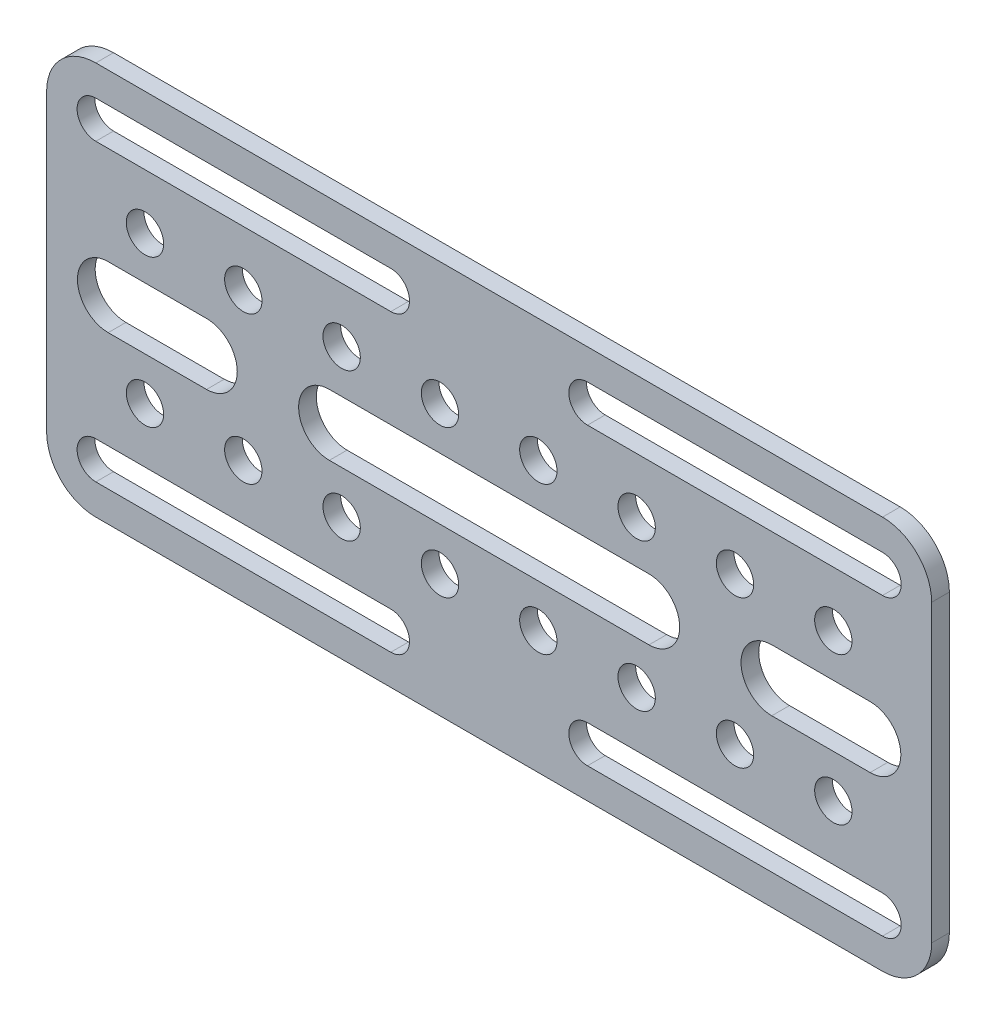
from build123d import *

# Parameters (mm, degrees)
SKETCH1_W            = 114.3
SKETCH1_H            = 50.8
EXTRUDE1_DEPTH       = 2.286
CUT_EXTRUDE1_DEPTH   = 63.58201256
LPATTERN1_COUNT      = 2
LPATTERN1_PITCH      = 63.5
LPATTERN1_COUNT_DIR2 = 2
LPATTERN1_PITCH_DIR2 = 38.1
SKETCH5_R            = 2.413
CUT_EXTRUDE4_DEPTH   = 63.58201256
LPATTERN3_COUNT      = 8
LPATTERN3_PITCH      = 12.7
LPATTERN3_COUNT_DIR2 = 2
LPATTERN3_PITCH_DIR2 = 19.05
CUT_EXTRUDE5_DEPTH   = 63.58201256
FILLET1_R            = 6.35


with BuildPart() as part:
    # Sketch1 → Extrude1 (new body)
    with BuildSketch(Plane.XY):
        Rectangle(SKETCH1_W, SKETCH1_H)
    extrude(amount=EXTRUDE1_DEPTH)

    # Sketch2 → Cut-Extrude1 (cut, through all)
    with BuildSketch(Plane.XY.offset(2.286)):
        with BuildLine():
            Line((-50.8, 21.463), (-12.7, 21.463))
            ThreePointArc((-12.7, 21.463), (-10.287, 19.05), (-12.7, 16.637))
            Line((-12.7, 16.637), (-50.8, 16.637))
            ThreePointArc((-50.8, 16.637), (-53.213, 19.05), (-50.8, 21.463))
        make_face()
    cut_extrude1 = extrude(amount=-CUT_EXTRUDE1_DEPTH, mode=Mode.SUBTRACT)

    # LPattern1: Cut-Extrude1 2 × 2
    with Locations(*[(i * LPATTERN1_PITCH, -j * LPATTERN1_PITCH_DIR2, 0) for i in range(LPATTERN1_COUNT) for j in range(LPATTERN1_COUNT_DIR2) if (i, j) != (0, 0)]):
        add(cut_extrude1, mode=Mode.SUBTRACT)

    # Sketch5 → Cut-Extrude4 (cut, through all)
    with BuildSketch(Plane.XY.offset(2.286)):
        with Locations((-44.45, 9.525)):
            Circle(SKETCH5_R)
    cut_extrude4 = extrude(amount=-CUT_EXTRUDE4_DEPTH, mode=Mode.SUBTRACT)

    # LPattern3: Cut-Extrude4 8 × 2
    with Locations(*[(i * LPATTERN3_PITCH, -j * LPATTERN3_PITCH_DIR2, 0) for i in range(LPATTERN3_COUNT) for j in range(LPATTERN3_COUNT_DIR2) if (i, j) != (0, 0)]):
        add(cut_extrude4, mode=Mode.SUBTRACT)

    # Sketch6 → Cut-Extrude5 (cut, through all)
    with BuildSketch(Plane.XY.offset(2.286)):
        with BuildLine():
            Line((-20.6375, 3.96875), (20.6375, 3.96875))
            ThreePointArc((20.6375, 3.96875), (24.60625, 0), (20.6375, -3.96875))
            Line((20.6375, -3.96875), (-20.6375, -3.96875))
            ThreePointArc((-20.6375, -3.96875), (-24.60625, 0), (-20.6375, 3.96875))
        make_face()
        with BuildLine():
            Line((-49.1998, 3.96875), (-36.4998, 3.96875))
            ThreePointArc((-36.4998, 3.96875), (-32.53105, 0), (-36.4998, -3.96875))
            Line((-36.4998, -3.96875), (-49.1998, -3.96875))
            ThreePointArc((-49.1998, -3.96875), (-53.16855, 0), (-49.1998, 3.96875))
        make_face()
        with BuildLine():
            Line((49.1998, 3.96875), (36.4998, 3.96875))
            ThreePointArc((36.4998, 3.96875), (32.53105, 0), (36.4998, -3.96875))
            Line((36.4998, -3.96875), (49.1998, -3.96875))
            ThreePointArc((49.1998, -3.96875), (53.16855, 0), (49.1998, 3.96875))
        make_face()
    extrude(amount=-CUT_EXTRUDE5_DEPTH, mode=Mode.SUBTRACT)

    # Fillet1
    fillet1_edges = [part.edges().sort_by_distance(p)[0] for p in [
        (-57.15, 25.4, 1.143),
        (57.15, 25.4, 1.143),
        (57.15, -25.4, 1.143),
        (-57.15, -25.4, 1.143),
    ]]
    fillet(fillet1_edges, radius=FILLET1_R)


solid = part.part
